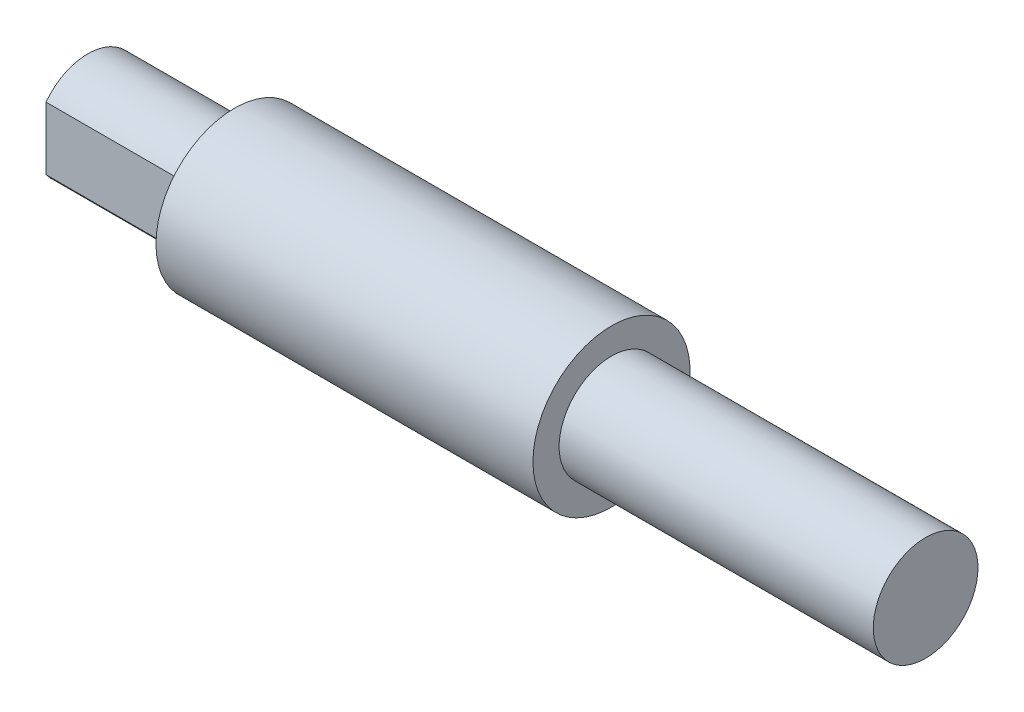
ISO-10303-21;
HEADER;
FILE_DESCRIPTION(('STEP AP214'),'2;1');
FILE_NAME('part.step','',(''),(''),'','','');
FILE_SCHEMA(('AUTOMOTIVE_DESIGN { 1 0 10303 214 1 1 1 1 }'));
ENDSEC;
DATA;
#1=APPLICATION_CONTEXT('core data for automotive mechanical design processes');
#2=APPLICATION_PROTOCOL_DEFINITION('international standard','automotive_design',2000,#1);
#3=PRODUCT_CONTEXT('',#1,'mechanical');
#4=PRODUCT('Part','Part','',(#3));
#5=PRODUCT_RELATED_PRODUCT_CATEGORY('part','',(#4));
#6=PRODUCT_DEFINITION_FORMATION('','',#4);
#7=PRODUCT_DEFINITION_CONTEXT('part definition',#1,'design');
#8=PRODUCT_DEFINITION('design','',#6,#7);
#9=PRODUCT_DEFINITION_SHAPE('','',#8);
#10=(LENGTH_UNIT() NAMED_UNIT(*) SI_UNIT(.MILLI.,.METRE.));
#11=(NAMED_UNIT(*) PLANE_ANGLE_UNIT() SI_UNIT($,.RADIAN.));
#12=(NAMED_UNIT(*) SI_UNIT($,.STERADIAN.) SOLID_ANGLE_UNIT());
#13=UNCERTAINTY_MEASURE_WITH_UNIT(LENGTH_MEASURE(1.E-05),#10,'distance_accuracy_value','');
#14=(GEOMETRIC_REPRESENTATION_CONTEXT(3) GLOBAL_UNCERTAINTY_ASSIGNED_CONTEXT((#13)) GLOBAL_UNIT_ASSIGNED_CONTEXT((#10,
#11,#12)) REPRESENTATION_CONTEXT('',''));
#15=CARTESIAN_POINT('',(0.,0.,0.));
#16=DIRECTION('',(0.,0.,1.));
#17=DIRECTION('',(1.,0.,0.));
#18=AXIS2_PLACEMENT_3D('',#15,#16,#17);
#19=CARTESIAN_POINT('',(80.,0.,0.));
#20=DIRECTION('',(-1.,0.,0.));
#21=DIRECTION('',(0.,0.,1.));
#22=AXIS2_PLACEMENT_3D('',#19,#20,#21);
#23=CYLINDRICAL_SURFACE('',#22,7.5);
#24=CARTESIAN_POINT('',(50.,0.,0.));
#25=DIRECTION('',(1.,0.,0.));
#26=DIRECTION('',(0.,0.,-1.));
#27=AXIS2_PLACEMENT_3D('',#24,#25,#26);
#28=CIRCLE('',#27,7.5);
#29=CARTESIAN_POINT('',(50.,0.,7.5));
#30=VERTEX_POINT('',#29);
#31=EDGE_CURVE('E12',#30,#30,#28,.T.);
#32=CARTESIAN_POINT('',(14.,0.,0.));
#33=DIRECTION('',(-1.,0.,0.));
#34=DIRECTION('',(0.,0.,1.));
#35=AXIS2_PLACEMENT_3D('',#32,#33,#34);
#36=CIRCLE('',#35,7.5);
#37=CARTESIAN_POINT('',(14.,0.,7.5));
#38=VERTEX_POINT('',#37);
#39=EDGE_CURVE('E38',#38,#38,#36,.T.);
#40=CARTESIAN_POINT('',(50.,0.,7.5));
#41=CARTESIAN_POINT('',(49.625,0.,7.5));
#42=CARTESIAN_POINT('',(49.25,0.,7.5));
#43=CARTESIAN_POINT('',(48.5,0.,7.5));
#44=CARTESIAN_POINT('',(48.125,0.,7.5));
#45=CARTESIAN_POINT('',(47.375,0.,7.5));
#46=CARTESIAN_POINT('',(47.,0.,7.5));
#47=CARTESIAN_POINT('',(46.25,0.,7.5));
#48=CARTESIAN_POINT('',(45.875,0.,7.5));
#49=CARTESIAN_POINT('',(45.125,0.,7.5));
#50=CARTESIAN_POINT('',(44.75,0.,7.5));
#51=CARTESIAN_POINT('',(44.,0.,7.5));
#52=CARTESIAN_POINT('',(43.625,0.,7.5));
#53=CARTESIAN_POINT('',(42.875,0.,7.5));
#54=CARTESIAN_POINT('',(42.5,0.,7.5));
#55=CARTESIAN_POINT('',(41.75,0.,7.5));
#56=CARTESIAN_POINT('',(41.375,0.,7.5));
#57=CARTESIAN_POINT('',(40.625,0.,7.5));
#58=CARTESIAN_POINT('',(40.25,0.,7.5));
#59=CARTESIAN_POINT('',(39.5,0.,7.5));
#60=CARTESIAN_POINT('',(39.125,0.,7.5));
#61=CARTESIAN_POINT('',(38.375,0.,7.5));
#62=CARTESIAN_POINT('',(38.,0.,7.5));
#63=CARTESIAN_POINT('',(37.25,0.,7.5));
#64=CARTESIAN_POINT('',(36.875,0.,7.5));
#65=CARTESIAN_POINT('',(36.125,0.,7.5));
#66=CARTESIAN_POINT('',(35.75,0.,7.5));
#67=CARTESIAN_POINT('',(35.,0.,7.5));
#68=CARTESIAN_POINT('',(34.625,0.,7.5));
#69=CARTESIAN_POINT('',(33.875,0.,7.5));
#70=CARTESIAN_POINT('',(33.5,0.,7.5));
#71=CARTESIAN_POINT('',(32.75,0.,7.5));
#72=CARTESIAN_POINT('',(32.375,0.,7.5));
#73=CARTESIAN_POINT('',(31.625,0.,7.5));
#74=CARTESIAN_POINT('',(31.25,0.,7.5));
#75=CARTESIAN_POINT('',(30.5,0.,7.5));
#76=CARTESIAN_POINT('',(30.125,0.,7.5));
#77=CARTESIAN_POINT('',(29.375,0.,7.5));
#78=CARTESIAN_POINT('',(29.,0.,7.5));
#79=CARTESIAN_POINT('',(28.25,0.,7.5));
#80=CARTESIAN_POINT('',(27.875,0.,7.5));
#81=CARTESIAN_POINT('',(27.125,0.,7.5));
#82=CARTESIAN_POINT('',(26.75,0.,7.5));
#83=CARTESIAN_POINT('',(26.,0.,7.5));
#84=CARTESIAN_POINT('',(25.625,0.,7.5));
#85=CARTESIAN_POINT('',(24.875,0.,7.5));
#86=CARTESIAN_POINT('',(24.5,0.,7.5));
#87=CARTESIAN_POINT('',(23.75,0.,7.5));
#88=CARTESIAN_POINT('',(23.375,0.,7.5));
#89=CARTESIAN_POINT('',(22.625,0.,7.5));
#90=CARTESIAN_POINT('',(22.25,0.,7.5));
#91=CARTESIAN_POINT('',(21.5,0.,7.5));
#92=CARTESIAN_POINT('',(21.125,0.,7.5));
#93=CARTESIAN_POINT('',(20.375,0.,7.5));
#94=CARTESIAN_POINT('',(20.,0.,7.5));
#95=CARTESIAN_POINT('',(19.25,0.,7.5));
#96=CARTESIAN_POINT('',(18.875,0.,7.5));
#97=CARTESIAN_POINT('',(18.125,0.,7.5));
#98=CARTESIAN_POINT('',(17.75,0.,7.5));
#99=CARTESIAN_POINT('',(17.,0.,7.5));
#100=CARTESIAN_POINT('',(16.625,0.,7.5));
#101=CARTESIAN_POINT('',(15.875,0.,7.5));
#102=CARTESIAN_POINT('',(15.5,0.,7.5));
#103=CARTESIAN_POINT('',(14.75,0.,7.5));
#104=CARTESIAN_POINT('',(14.375,0.,7.5));
#105=CARTESIAN_POINT('',(14.,0.,7.5));
#106=B_SPLINE_CURVE_WITH_KNOTS('',3,(#40,#41,#42,#43,#44,#45,#46,#47,#48,#49,#50,#51,#52,#53,
#54,#55,#56,#57,#58,#59,#60,#61,#62,#63,#64,#65,#66,#67,#68,#69,#70,#71,#72,#73,#74,#75,#76,#77,
#78,#79,#80,#81,#82,#83,#84,#85,#86,#87,#88,#89,#90,#91,#92,#93,#94,#95,#96,#97,#98,#99,#100,
#101,#102,#103,#104,#105),.UNSPECIFIED.,.F.,.F.,(4,2,2,2,2,2,2,2,2,2,2,2,2,2,2,2,2,2,2,2,2,2,2,
2,2,2,2,2,2,2,2,2,4),(0.,1.125,2.25,3.375,4.5,5.625,6.75,7.875,9.,10.125,11.25,12.375,13.5,
14.625,15.75,16.875,18.,19.125,20.25,21.375,22.5,23.625,24.75,25.875,27.,28.125,29.25,30.375,
31.5,32.625,33.75,34.875,36.),.UNSPECIFIED.);
#107=EDGE_CURVE('BSEAM35',#30,#38,#106,.T.);
#108=ORIENTED_EDGE('',*,*,#31,.F.);
#109=ORIENTED_EDGE('',*,*,#39,.F.);
#110=ORIENTED_EDGE('',*,*,#107,.T.);
#111=ORIENTED_EDGE('',*,*,#107,.F.);
#112=EDGE_LOOP('',(#108,#110,#109,#111));
#113=FACE_BOUND('',#112,.T.);
#114=ADVANCED_FACE('F35',(#113),#23,.T.);
#115=CARTESIAN_POINT('',(50.,0.,0.));
#116=DIRECTION('',(1.,0.,0.));
#117=DIRECTION('',(0.,0.,-1.));
#118=AXIS2_PLACEMENT_3D('',#115,#116,#117);
#119=PLANE('',#118);
#120=CARTESIAN_POINT('',(50.,0.,0.));
#121=DIRECTION('',(1.,0.,0.));
#122=DIRECTION('',(0.,0.,-1.));
#123=AXIS2_PLACEMENT_3D('',#120,#121,#122);
#124=CIRCLE('',#123,5.);
#125=CARTESIAN_POINT('',(50.,0.,-5.));
#126=VERTEX_POINT('',#125);
#127=EDGE_CURVE('E43',#126,#126,#124,.T.);
#128=ORIENTED_EDGE('',*,*,#127,.F.);
#129=EDGE_LOOP('',(#128));
#130=FACE_BOUND('',#129,.T.);
#131=ORIENTED_EDGE('',*,*,#31,.T.);
#132=EDGE_LOOP('',(#131));
#133=FACE_BOUND('',#132,.T.);
#134=ADVANCED_FACE('F123',(#130,#133),#119,.T.);
#135=CARTESIAN_POINT('',(50.,0.,0.));
#136=DIRECTION('',(1.,0.,0.));
#137=DIRECTION('',(0.,0.,-1.));
#138=AXIS2_PLACEMENT_3D('',#135,#136,#137);
#139=CYLINDRICAL_SURFACE('',#138,5.);
#140=ORIENTED_EDGE('',*,*,#127,.T.);
#141=EDGE_LOOP('',(#140));
#142=FACE_BOUND('',#141,.T.);
#143=CARTESIAN_POINT('',(80.,0.,0.));
#144=DIRECTION('',(1.,0.,0.));
#145=DIRECTION('',(0.,0.,-1.));
#146=AXIS2_PLACEMENT_3D('',#143,#144,#145);
#147=CIRCLE('',#146,5.);
#148=CARTESIAN_POINT('',(80.,0.,-5.));
#149=VERTEX_POINT('',#148);
#150=EDGE_CURVE('E115',#149,#149,#147,.T.);
#151=ORIENTED_EDGE('',*,*,#150,.F.);
#152=EDGE_LOOP('',(#151));
#153=FACE_BOUND('',#152,.T.);
#154=ADVANCED_FACE('F128',(#142,#153),#139,.T.);
#155=CARTESIAN_POINT('',(80.,0.,0.));
#156=DIRECTION('',(1.,0.,0.));
#157=DIRECTION('',(0.,0.,-1.));
#158=AXIS2_PLACEMENT_3D('',#155,#156,#157);
#159=PLANE('',#158);
#160=ORIENTED_EDGE('',*,*,#150,.T.);
#161=EDGE_LOOP('',(#160));
#162=FACE_BOUND('',#161,.T.);
#163=ADVANCED_FACE('F136',(#162),#159,.T.);
#164=CARTESIAN_POINT('',(14.,0.,0.));
#165=DIRECTION('',(-1.,0.,0.));
#166=DIRECTION('',(0.,0.,1.));
#167=AXIS2_PLACEMENT_3D('',#164,#165,#166);
#168=PLANE('',#167);
#169=DIRECTION('',(0.,1.,0.));
#170=VECTOR('',#169,1.);
#171=CARTESIAN_POINT('',(14.,3.,4.));
#172=LINE('',#171,#170);
#173=CARTESIAN_POINT('',(14.,-3.,4.));
#174=VERTEX_POINT('',#173);
#175=CARTESIAN_POINT('',(14.,3.,4.));
#176=VERTEX_POINT('',#175);
#177=EDGE_CURVE('E88',#174,#176,#172,.T.);
#178=ORIENTED_EDGE('',*,*,#177,.F.);
#179=CARTESIAN_POINT('',(14.,0.,0.));
#180=DIRECTION('',(-1.,0.,0.));
#181=DIRECTION('',(0.,0.,1.));
#182=AXIS2_PLACEMENT_3D('',#179,#180,#181);
#183=CIRCLE('',#182,5.);
#184=CARTESIAN_POINT('',(14.,-3.,-4.));
#185=VERTEX_POINT('',#184);
#186=EDGE_CURVE('E58',#185,#174,#183,.T.);
#187=ORIENTED_EDGE('',*,*,#186,.F.);
#188=DIRECTION('',(0.,-1.,0.));
#189=VECTOR('',#188,1.);
#190=CARTESIAN_POINT('',(14.,3.,-4.));
#191=LINE('',#190,#189);
#192=CARTESIAN_POINT('',(14.,3.,-4.));
#193=VERTEX_POINT('',#192);
#194=EDGE_CURVE('E80',#193,#185,#191,.T.);
#195=ORIENTED_EDGE('',*,*,#194,.F.);
#196=CARTESIAN_POINT('',(14.,0.,0.));
#197=DIRECTION('',(-1.,0.,0.));
#198=DIRECTION('',(0.,0.,1.));
#199=AXIS2_PLACEMENT_3D('',#196,#197,#198);
#200=CIRCLE('',#199,5.);
#201=EDGE_CURVE('E93',#176,#193,#200,.T.);
#202=ORIENTED_EDGE('',*,*,#201,.F.);
#203=EDGE_LOOP('',(#178,#187,#195,#202));
#204=FACE_BOUND('',#203,.T.);
#205=ORIENTED_EDGE('',*,*,#39,.T.);
#206=EDGE_LOOP('',(#205));
#207=FACE_BOUND('',#206,.T.);
#208=ADVANCED_FACE('F91',(#204,#207),#168,.T.);
#209=CARTESIAN_POINT('',(14.,0.,0.));
#210=DIRECTION('',(-1.,0.,0.));
#211=DIRECTION('',(0.,0.,1.));
#212=AXIS2_PLACEMENT_3D('',#209,#210,#211);
#213=CYLINDRICAL_SURFACE('',#212,5.);
#214=CARTESIAN_POINT('',(0.,0.,0.));
#215=DIRECTION('',(-1.,0.,0.));
#216=DIRECTION('',(0.,0.,1.));
#217=AXIS2_PLACEMENT_3D('',#214,#215,#216);
#218=CIRCLE('',#217,5.);
#219=CARTESIAN_POINT('',(0.,3.,4.));
#220=VERTEX_POINT('',#219);
#221=CARTESIAN_POINT('',(0.,3.,-4.));
#222=VERTEX_POINT('',#221);
#223=EDGE_CURVE('E105',#220,#222,#218,.T.);
#224=ORIENTED_EDGE('',*,*,#223,.F.);
#225=DIRECTION('',(-1.,0.,0.));
#226=VECTOR('',#225,1.);
#227=CARTESIAN_POINT('',(14.,3.,4.));
#228=LINE('',#227,#226);
#229=EDGE_CURVE('E97',#176,#220,#228,.T.);
#230=ORIENTED_EDGE('',*,*,#229,.F.);
#231=ORIENTED_EDGE('',*,*,#201,.T.);
#232=DIRECTION('',(-1.,0.,0.));
#233=VECTOR('',#232,1.);
#234=CARTESIAN_POINT('',(14.,3.,-4.));
#235=LINE('',#234,#233);
#236=EDGE_CURVE('E78',#193,#222,#235,.T.);
#237=ORIENTED_EDGE('',*,*,#236,.T.);
#238=EDGE_LOOP('',(#224,#230,#231,#237));
#239=FACE_BOUND('',#238,.T.);
#240=ADVANCED_FACE('F96',(#239),#213,.T.);
#241=CARTESIAN_POINT('',(14.,3.,4.));
#242=DIRECTION('',(0.,0.,1.));
#243=DIRECTION('',(1.,0.,0.));
#244=AXIS2_PLACEMENT_3D('',#241,#242,#243);
#245=PLANE('',#244);
#246=DIRECTION('',(0.,1.,0.));
#247=VECTOR('',#246,1.);
#248=CARTESIAN_POINT('',(0.,3.,4.));
#249=LINE('',#248,#247);
#250=CARTESIAN_POINT('',(0.,-3.,4.));
#251=VERTEX_POINT('',#250);
#252=EDGE_CURVE('E98',#251,#220,#249,.T.);
#253=ORIENTED_EDGE('',*,*,#252,.F.);
#254=DIRECTION('',(-1.,0.,0.));
#255=VECTOR('',#254,1.);
#256=CARTESIAN_POINT('',(14.,-3.,4.));
#257=LINE('',#256,#255);
#258=EDGE_CURVE('E110',#174,#251,#257,.T.);
#259=ORIENTED_EDGE('',*,*,#258,.F.);
#260=ORIENTED_EDGE('',*,*,#177,.T.);
#261=ORIENTED_EDGE('',*,*,#229,.T.);
#262=EDGE_LOOP('',(#253,#259,#260,#261));
#263=FACE_BOUND('',#262,.T.);
#264=ADVANCED_FACE('F153',(#263),#245,.T.);
#265=CARTESIAN_POINT('',(14.,0.,0.));
#266=DIRECTION('',(-1.,0.,0.));
#267=DIRECTION('',(0.,0.,1.));
#268=AXIS2_PLACEMENT_3D('',#265,#266,#267);
#269=CYLINDRICAL_SURFACE('',#268,5.);
#270=CARTESIAN_POINT('',(0.,0.,0.));
#271=DIRECTION('',(-1.,0.,0.));
#272=DIRECTION('',(0.,0.,1.));
#273=AXIS2_PLACEMENT_3D('',#270,#271,#272);
#274=CIRCLE('',#273,5.);
#275=CARTESIAN_POINT('',(0.,-3.,-4.));
#276=VERTEX_POINT('',#275);
#277=EDGE_CURVE('E50',#276,#251,#274,.T.);
#278=ORIENTED_EDGE('',*,*,#277,.F.);
#279=DIRECTION('',(-1.,0.,0.));
#280=VECTOR('',#279,1.);
#281=CARTESIAN_POINT('',(14.,-3.,-4.));
#282=LINE('',#281,#280);
#283=EDGE_CURVE('E87',#185,#276,#282,.T.);
#284=ORIENTED_EDGE('',*,*,#283,.F.);
#285=ORIENTED_EDGE('',*,*,#186,.T.);
#286=ORIENTED_EDGE('',*,*,#258,.T.);
#287=EDGE_LOOP('',(#278,#284,#285,#286));
#288=FACE_BOUND('',#287,.T.);
#289=ADVANCED_FACE('F149',(#288),#269,.T.);
#290=CARTESIAN_POINT('',(14.,3.,-4.));
#291=DIRECTION('',(0.,0.,-1.));
#292=DIRECTION('',(-1.,0.,0.));
#293=AXIS2_PLACEMENT_3D('',#290,#291,#292);
#294=PLANE('',#293);
#295=DIRECTION('',(0.,-1.,0.));
#296=VECTOR('',#295,1.);
#297=CARTESIAN_POINT('',(0.,3.,-4.));
#298=LINE('',#297,#296);
#299=EDGE_CURVE('E82',#222,#276,#298,.T.);
#300=ORIENTED_EDGE('',*,*,#299,.F.);
#301=ORIENTED_EDGE('',*,*,#236,.F.);
#302=ORIENTED_EDGE('',*,*,#194,.T.);
#303=ORIENTED_EDGE('',*,*,#283,.T.);
#304=EDGE_LOOP('',(#300,#301,#302,#303));
#305=FACE_BOUND('',#304,.T.);
#306=ADVANCED_FACE('F79',(#305),#294,.T.);
#307=CARTESIAN_POINT('',(0.,0.,0.));
#308=DIRECTION('',(1.,0.,0.));
#309=DIRECTION('',(0.,0.,-1.));
#310=AXIS2_PLACEMENT_3D('',#307,#308,#309);
#311=PLANE('',#310);
#312=ORIENTED_EDGE('',*,*,#223,.T.);
#313=ORIENTED_EDGE('',*,*,#299,.T.);
#314=ORIENTED_EDGE('',*,*,#277,.T.);
#315=ORIENTED_EDGE('',*,*,#252,.T.);
#316=EDGE_LOOP('',(#312,#313,#314,#315));
#317=FACE_BOUND('',#316,.T.);
#318=ADVANCED_FACE('F143',(#317),#311,.F.);
#319=CLOSED_SHELL('',(#114,#134,#154,#163,#208,#240,#264,#289,#306,#318));
#320=MANIFOLD_SOLID_BREP('B2',#319);
#321=ADVANCED_BREP_SHAPE_REPRESENTATION('',(#18,#320),#14);
#322=SHAPE_DEFINITION_REPRESENTATION(#9,#321);
ENDSEC;
END-ISO-10303-21;
